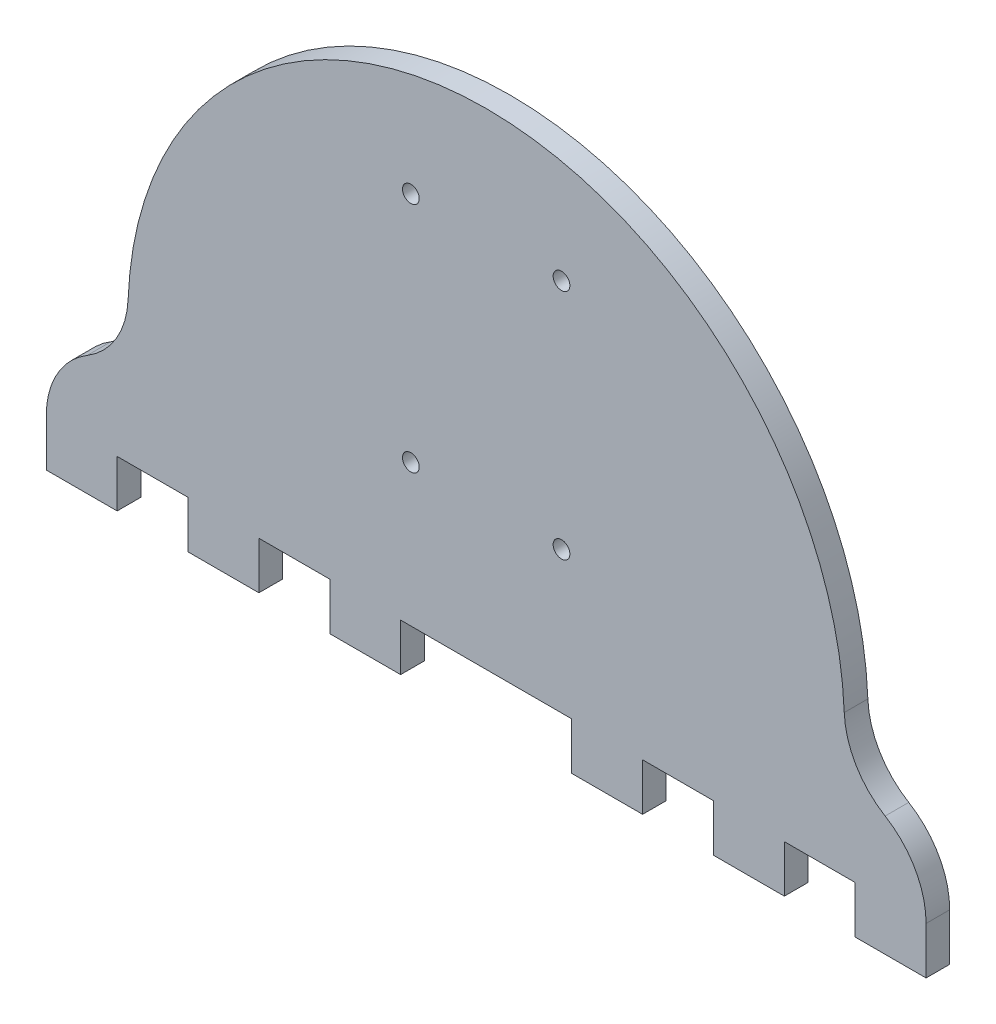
from build123d import *

# Parameters (mm, degrees)
SKETCH1_R           = 2.25
BOSS_EXTRUDE1_DEPTH = 6.35


with BuildPart() as part:
    # Sketch1 → Boss-Extrude1 (new body)
    with BuildSketch(Plane.XY):
        with BuildLine():
            Line((-118.25, -59.1), (-118.25, -71.8))
            Line((-118.25, -71.8), (-99.2, -71.8))
            Line((-99.2, -71.8), (-99.2, -59.1))
            Line((-99.2, -59.1), (-80.15, -59.1))
            Line((-80.15, -59.1), (-80.15, -71.8))
            Line((-80.15, -71.8), (-61.1, -71.8))
            Line((-61.1, -71.8), (-61.1, -59.1))
            Line((-61.1, -59.1), (-42.05, -59.1))
            Line((-42.05, -59.1), (-42.05, -71.8))
            Line((-42.05, -71.8), (-23, -71.8))
            Line((-23, -71.8), (-23, -59.1))
            Line((-23, -59.1), (23, -59.1))
            Line((23, -59.1), (23, -71.8))
            Line((23, -71.8), (42.05, -71.8))
            Line((42.05, -71.8), (42.05, -59.1))
            Line((42.05, -59.1), (61.1, -59.1))
            Line((61.1, -59.1), (61.1, -71.8))
            Line((61.1, -71.8), (80.15, -71.8))
            Line((80.15, -71.8), (80.15, -59.1))
            Line((80.15, -59.1), (99.2, -59.1))
            Line((99.2, -59.1), (99.2, -71.8))
            Line((99.2, -71.8), (118.25, -71.8))
            Line((118.25, -71.8), (118.25, -59.1))
            ThreePointArc((118.25, -59.1), (115.307730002, -47.902449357), (107.241012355, -39.597621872))
            ThreePointArc((107.241012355, -39.597621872), (99.400632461, -31.684608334), (96.25, -21))
            ThreePointArc((96.25, -21), (66.746371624, 44.626292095), (0, 71.5))
            ThreePointArc((0, 71.5), (-66.746371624, 44.626292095), (-96.25, -21))
            ThreePointArc((-96.25, -21), (-99.400632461, -31.684608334), (-107.241012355, -39.597621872))
            ThreePointArc((-107.241012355, -39.597621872), (-115.307730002, -47.902449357), (-118.25, -59.1))
        make_face()
        with Locations((-20.25, -21)):
            Circle(SKETCH1_R, mode=Mode.SUBTRACT)
        with Locations((20.25, -21)):
            Circle(SKETCH1_R, mode=Mode.SUBTRACT)
        with Locations((-20.25, 41.5)):
            Circle(SKETCH1_R, mode=Mode.SUBTRACT)
        with Locations((20.25, 41.5)):
            Circle(SKETCH1_R, mode=Mode.SUBTRACT)
    extrude(amount=BOSS_EXTRUDE1_DEPTH)


solid = part.part
